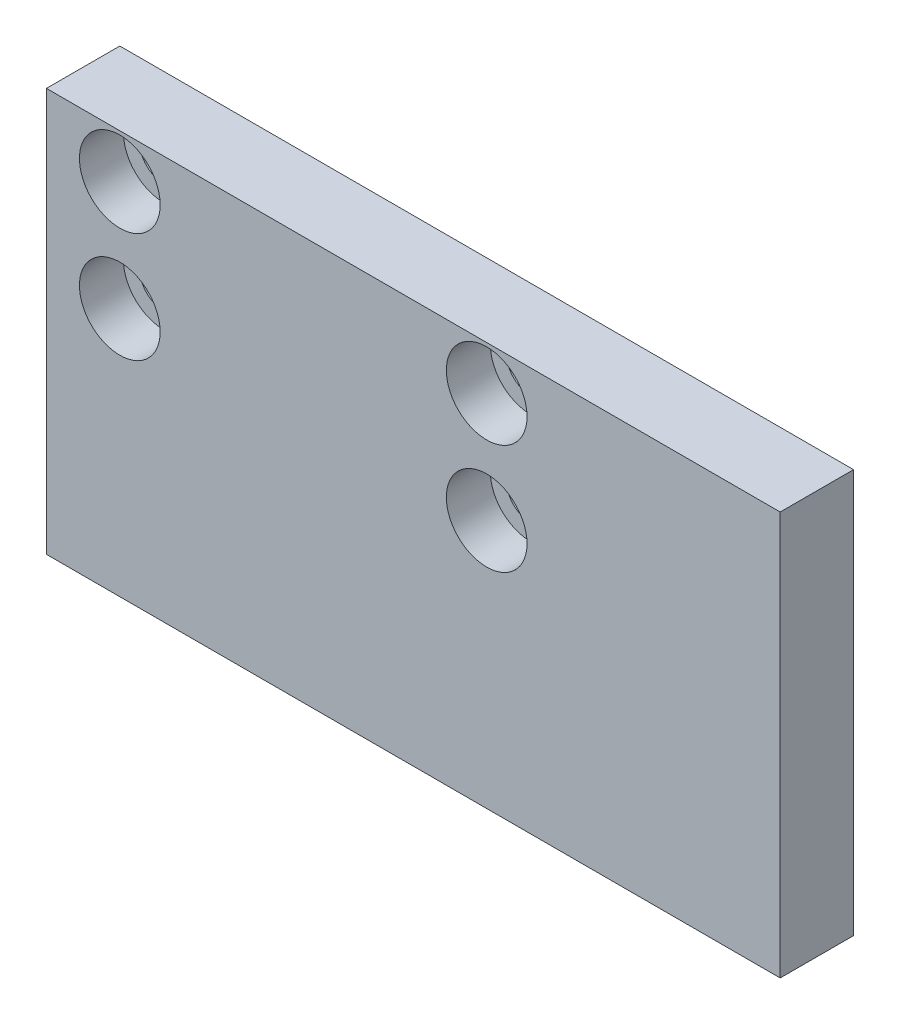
from build123d import *

# Parameters (mm, degrees)
ESQUISSE1_W                                        = 100
ESQUISSE1_H                                        = 55
EXTRUSION1_DEPTH                                   = 10
CHAMBRAGE_POUR_VIS_T_TE_HEXAGONALE_M61_D           = 6.6
CHAMBRAGE_POUR_VIS_T_TE_HEXAGONALE_M61_CBORE_D     = 11
CHAMBRAGE_POUR_VIS_T_TE_HEXAGONALE_M61_CBORE_DEPTH = 6
TROU_TARAUD_M4X0_71_D                              = 3.3
TROU_TARAUD_M4X0_71_DEPTH                          = 10
TROU_TARAUD_M4X0_71_TIP                            = 0.991420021


with BuildPart() as part:
    # Esquisse1 → Extrusion1 (new body)
    with BuildSketch(Plane.XY):
        with Locations((30, 0)):
            Rectangle(ESQUISSE1_W, ESQUISSE1_H)
    extrude(amount=EXTRUSION1_DEPTH)

    # Chambrage pour vis _ t_te hexagonale M61 (through all)
    with Locations(Plane.XY.offset(10)):
        with Locations((40, 6.5), (40, 21.5), (-10, 21.5), (-10, 6.5)):
            CounterBoreHole(CHAMBRAGE_POUR_VIS_T_TE_HEXAGONALE_M61_D / 2, CHAMBRAGE_POUR_VIS_T_TE_HEXAGONALE_M61_CBORE_D / 2, CHAMBRAGE_POUR_VIS_T_TE_HEXAGONALE_M61_CBORE_DEPTH)

    # Trou taraud_ M4x0.71
    with Locations(Plane(origin=(-18.185036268, -27.5, -2.128708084), x_dir=(-1, 0, 0), z_dir=(0, -1, 0))):
        with Locations((-93.185036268, -7.128708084), (-75.685036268, -7.128708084), (-58.185036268, -7.128708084)):
            Hole(TROU_TARAUD_M4X0_71_D / 2, depth=TROU_TARAUD_M4X0_71_DEPTH)
            with Locations((0, 0, -(TROU_TARAUD_M4X0_71_DEPTH + TROU_TARAUD_M4X0_71_TIP / 2))):  # 118° drill point
                Cone(0, TROU_TARAUD_M4X0_71_D / 2, TROU_TARAUD_M4X0_71_TIP, mode=Mode.SUBTRACT)


solid = part.part
